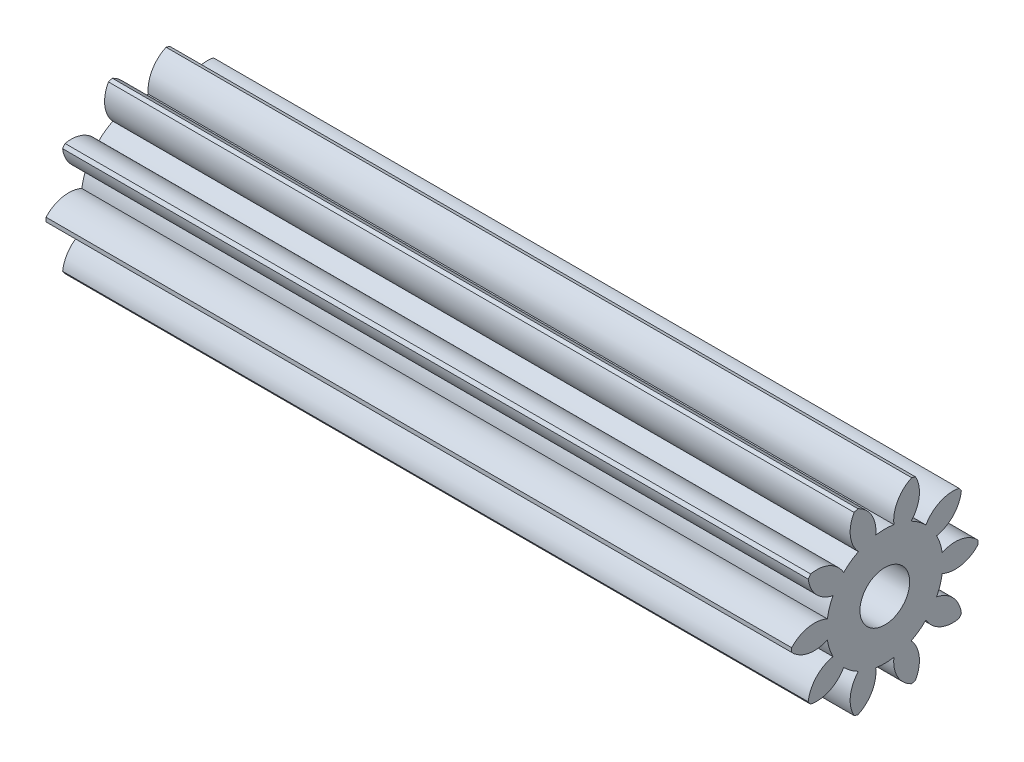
ISO-10303-21;
HEADER;
FILE_DESCRIPTION(('STEP AP214'),'2;1');
FILE_NAME('part.step','',(''),(''),'','','');
FILE_SCHEMA(('AUTOMOTIVE_DESIGN { 1 0 10303 214 1 1 1 1 }'));
ENDSEC;
DATA;
#1=APPLICATION_CONTEXT('core data for automotive mechanical design processes');
#2=APPLICATION_PROTOCOL_DEFINITION('international standard','automotive_design',2000,#1);
#3=PRODUCT_CONTEXT('',#1,'mechanical');
#4=PRODUCT('Part','Part','',(#3));
#5=PRODUCT_RELATED_PRODUCT_CATEGORY('part','',(#4));
#6=PRODUCT_DEFINITION_FORMATION('','',#4);
#7=PRODUCT_DEFINITION_CONTEXT('part definition',#1,'design');
#8=PRODUCT_DEFINITION('design','',#6,#7);
#9=PRODUCT_DEFINITION_SHAPE('','',#8);
#10=(LENGTH_UNIT() NAMED_UNIT(*) SI_UNIT(.MILLI.,.METRE.));
#11=(NAMED_UNIT(*) PLANE_ANGLE_UNIT() SI_UNIT($,.RADIAN.));
#12=(NAMED_UNIT(*) SI_UNIT($,.STERADIAN.) SOLID_ANGLE_UNIT());
#13=UNCERTAINTY_MEASURE_WITH_UNIT(LENGTH_MEASURE(1.E-05),#10,'distance_accuracy_value','');
#14=(GEOMETRIC_REPRESENTATION_CONTEXT(3) GLOBAL_UNCERTAINTY_ASSIGNED_CONTEXT((#13)) GLOBAL_UNIT_ASSIGNED_CONTEXT((#10,
#11,#12)) REPRESENTATION_CONTEXT('',''));
#15=CARTESIAN_POINT('',(0.,0.,0.));
#16=DIRECTION('',(0.,0.,1.));
#17=DIRECTION('',(1.,0.,0.));
#18=AXIS2_PLACEMENT_3D('',#15,#16,#17);
#19=CARTESIAN_POINT('',(12.,0.,0.));
#20=DIRECTION('',(-1.,0.,0.));
#21=DIRECTION('',(0.,0.,1.));
#22=AXIS2_PLACEMENT_3D('',#19,#20,#21);
#23=PLANE('',#22);
#24=CARTESIAN_POINT('',(12.,0.417375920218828,-1.09796154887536));
#25=DIRECTION('',(-1.,0.,0.));
#26=DIRECTION('',(0.,-0.587785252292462,-0.809016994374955));
#27=AXIS2_PLACEMENT_3D('',#24,#25,#26);
#28=CIRCLE('',#27,0.5);
#29=CARTESIAN_POINT('',(12.,0.662334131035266,-0.662076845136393));
#30=VERTEX_POINT('',#29);
#31=CARTESIAN_POINT('',(12.,0.908086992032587,-1.1938919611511));
#32=VERTEX_POINT('',#31);
#33=EDGE_CURVE('E304',#30,#32,#28,.T.);
#34=ORIENTED_EDGE('',*,*,#33,.F.);
#35=CARTESIAN_POINT('',(12.,0.,0.));
#36=DIRECTION('',(-1.,0.,0.));
#37=DIRECTION('',(0.,-0.587785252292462,-0.809016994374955));
#38=AXIS2_PLACEMENT_3D('',#35,#36,#37);
#39=CIRCLE('',#38,0.9365);
#40=CARTESIAN_POINT('',(12.,0.834345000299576,-0.42532419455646));
#41=VERTEX_POINT('',#40);
#42=EDGE_CURVE('E527',#41,#30,#39,.T.);
#43=ORIENTED_EDGE('',*,*,#42,.F.);
#44=CARTESIAN_POINT('',(12.,1.17319973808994,-0.0576593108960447));
#45=DIRECTION('',(-1.,0.,0.));
#46=DIRECTION('',(0.,-0.587785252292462,-0.809016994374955));
#47=AXIS2_PLACEMENT_3D('',#44,#45,#46);
#48=CIRCLE('',#47,0.5);
#49=CARTESIAN_POINT('',(12.,1.41607304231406,-0.494709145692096));
#50=VERTEX_POINT('',#49);
#51=EDGE_CURVE('E294',#50,#41,#48,.T.);
#52=ORIENTED_EDGE('',*,*,#51,.F.);
#53=CARTESIAN_POINT('',(12.,0.,0.));
#54=DIRECTION('',(-1.,0.,0.));
#55=DIRECTION('',(0.,0.,1.));
#56=AXIS2_PLACEMENT_3D('',#53,#54,#55);
#57=CIRCLE('',#56,1.5);
#58=CARTESIAN_POINT('',(12.,1.43640989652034,-0.432118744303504));
#59=VERTEX_POINT('',#58);
#60=EDGE_CURVE('E322',#59,#50,#57,.T.);
#61=ORIENTED_EDGE('',*,*,#60,.F.);
#62=CARTESIAN_POINT('',(12.,0.983029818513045,-0.642942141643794));
#63=DIRECTION('',(-1.,0.,0.));
#64=DIRECTION('',(0.,0.,-1.));
#65=AXIS2_PLACEMENT_3D('',#62,#63,#64);
#66=CIRCLE('',#65,0.5);
#67=CARTESIAN_POINT('',(12.,0.924998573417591,-0.146321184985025));
#68=VERTEX_POINT('',#67);
#69=EDGE_CURVE('E346',#68,#59,#66,.T.);
#70=ORIENTED_EDGE('',*,*,#69,.F.);
#71=CARTESIAN_POINT('',(12.,0.,0.));
#72=DIRECTION('',(-1.,0.,0.));
#73=DIRECTION('',(0.,0.,-1.));
#74=AXIS2_PLACEMENT_3D('',#71,#72,#73);
#75=CIRCLE('',#74,0.9365);
#76=CARTESIAN_POINT('',(12.,0.924998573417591,0.146321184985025));
#77=VERTEX_POINT('',#76);
#78=EDGE_CURVE('E342',#77,#68,#75,.T.);
#79=ORIENTED_EDGE('',*,*,#78,.F.);
#80=CARTESIAN_POINT('',(12.,0.983029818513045,0.642942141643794));
#81=DIRECTION('',(-1.,0.,0.));
#82=DIRECTION('',(0.,0.,-1.));
#83=AXIS2_PLACEMENT_3D('',#80,#81,#82);
#84=CIRCLE('',#83,0.5);
#85=CARTESIAN_POINT('',(12.,1.43640989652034,0.432118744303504));
#86=VERTEX_POINT('',#85);
#87=EDGE_CURVE('E344',#86,#77,#84,.T.);
#88=ORIENTED_EDGE('',*,*,#87,.F.);
#89=CARTESIAN_POINT('',(12.,1.41607304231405,0.494709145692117));
#90=VERTEX_POINT('',#89);
#91=EDGE_CURVE('E316',#90,#86,#57,.T.);
#92=ORIENTED_EDGE('',*,*,#91,.F.);
#93=CARTESIAN_POINT('',(12.,1.17319973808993,0.0576593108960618));
#94=DIRECTION('',(-1.,0.,0.));
#95=DIRECTION('',(0.,0.587785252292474,-0.809016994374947));
#96=AXIS2_PLACEMENT_3D('',#93,#94,#95);
#97=CIRCLE('',#96,0.5);
#98=CARTESIAN_POINT('',(12.,0.83434500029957,0.425324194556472));
#99=VERTEX_POINT('',#98);
#100=EDGE_CURVE('E365',#99,#90,#97,.T.);
#101=ORIENTED_EDGE('',*,*,#100,.F.);
#102=CARTESIAN_POINT('',(12.,0.,0.));
#103=DIRECTION('',(-1.,0.,0.));
#104=DIRECTION('',(0.,0.587785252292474,-0.809016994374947));
#105=AXIS2_PLACEMENT_3D('',#102,#103,#104);
#106=CIRCLE('',#105,0.9365);
#107=CARTESIAN_POINT('',(12.,0.662334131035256,0.662076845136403));
#108=VERTEX_POINT('',#107);
#109=EDGE_CURVE('E361',#108,#99,#106,.T.);
#110=ORIENTED_EDGE('',*,*,#109,.F.);
#111=CARTESIAN_POINT('',(12.,0.417375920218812,1.09796154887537));
#112=DIRECTION('',(-1.,0.,0.));
#113=DIRECTION('',(0.,0.587785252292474,-0.809016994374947));
#114=AXIS2_PLACEMENT_3D('',#111,#112,#113);
#115=CIRCLE('',#114,0.5);
#116=CARTESIAN_POINT('',(12.,0.90808699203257,1.19389196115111));
#117=VERTEX_POINT('',#116);
#118=EDGE_CURVE('E363',#117,#108,#115,.T.);
#119=ORIENTED_EDGE('',*,*,#118,.F.);
#120=CARTESIAN_POINT('',(12.,0.854844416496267,1.23257495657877));
#121=VERTEX_POINT('',#120);
#122=EDGE_CURVE('E320',#121,#117,#57,.T.);
#123=ORIENTED_EDGE('',*,*,#122,.F.);
#124=CARTESIAN_POINT('',(12.,0.915247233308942,0.73623686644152));
#125=DIRECTION('',(-1.,0.,0.));
#126=DIRECTION('',(0.,0.951056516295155,-0.309016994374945));
#127=AXIS2_PLACEMENT_3D('',#124,#125,#126);
#128=CIRCLE('',#127,0.5);
#129=CARTESIAN_POINT('',(12.,0.424999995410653,0.834510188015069));
#130=VERTEX_POINT('',#129);
#131=EDGE_CURVE('E386',#130,#121,#128,.T.);
#132=ORIENTED_EDGE('',*,*,#131,.F.);
#133=CARTESIAN_POINT('',(12.,0.,0.));
#134=DIRECTION('',(-1.,0.,0.));
#135=DIRECTION('',(0.,0.951056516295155,-0.309016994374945));
#136=AXIS2_PLACEMENT_3D('',#133,#134,#135);
#137=CIRCLE('',#136,0.9365);
#138=CARTESIAN_POINT('',(12.,0.146680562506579,0.924941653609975));
#139=VERTEX_POINT('',#138);
#140=EDGE_CURVE('E382',#139,#130,#137,.T.);
#141=ORIENTED_EDGE('',*,*,#140,.F.);
#142=CARTESIAN_POINT('',(12.,-0.307701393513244,1.13359696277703));
#143=DIRECTION('',(-1.,0.,0.));
#144=DIRECTION('',(0.,0.951056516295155,-0.309016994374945));
#145=AXIS2_PLACEMENT_3D('',#142,#143,#144);
#146=CIRCLE('',#145,0.5);
#147=CARTESIAN_POINT('',(12.,0.0329057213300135,1.49963902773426));
#148=VERTEX_POINT('',#147);
#149=EDGE_CURVE('E384',#148,#139,#146,.T.);
#150=ORIENTED_EDGE('',*,*,#149,.F.);
#151=CARTESIAN_POINT('',(12.,-0.032905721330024,1.49963902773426));
#152=VERTEX_POINT('',#151);
#153=EDGE_CURVE('E639',#152,#148,#57,.T.);
#154=ORIENTED_EDGE('',*,*,#153,.F.);
#155=CARTESIAN_POINT('',(12.,0.307701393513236,1.13359696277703));
#156=DIRECTION('',(-1.,0.,0.));
#157=DIRECTION('',(0.,0.951056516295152,0.309016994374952));
#158=AXIS2_PLACEMENT_3D('',#155,#156,#157);
#159=CIRCLE('',#158,0.5);
#160=CARTESIAN_POINT('',(12.,-0.146680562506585,0.924941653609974));
#161=VERTEX_POINT('',#160);
#162=EDGE_CURVE('E408',#161,#152,#159,.T.);
#163=ORIENTED_EDGE('',*,*,#162,.F.);
#164=CARTESIAN_POINT('',(12.,0.,0.));
#165=DIRECTION('',(-1.,0.,0.));
#166=DIRECTION('',(0.,0.951056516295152,0.309016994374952));
#167=AXIS2_PLACEMENT_3D('',#164,#165,#166);
#168=CIRCLE('',#167,0.9365);
#169=CARTESIAN_POINT('',(12.,-0.424999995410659,0.834510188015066));
#170=VERTEX_POINT('',#169);
#171=EDGE_CURVE('E404',#170,#161,#168,.T.);
#172=ORIENTED_EDGE('',*,*,#171,.F.);
#173=CARTESIAN_POINT('',(12.,-0.915247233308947,0.736236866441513));
#174=DIRECTION('',(-1.,0.,0.));
#175=DIRECTION('',(0.,0.951056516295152,0.309016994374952));
#176=AXIS2_PLACEMENT_3D('',#173,#174,#175);
#177=CIRCLE('',#176,0.5);
#178=CARTESIAN_POINT('',(12.,-0.854844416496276,1.23257495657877));
#179=VERTEX_POINT('',#178);
#180=EDGE_CURVE('E406',#179,#170,#177,.T.);
#181=ORIENTED_EDGE('',*,*,#180,.F.);
#182=CARTESIAN_POINT('',(12.,-0.908086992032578,1.1938919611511));
#183=VERTEX_POINT('',#182);
#184=EDGE_CURVE('E634',#183,#179,#57,.T.);
#185=ORIENTED_EDGE('',*,*,#184,.F.);
#186=CARTESIAN_POINT('',(12.,-0.41737592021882,1.09796154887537));
#187=DIRECTION('',(-1.,0.,0.));
#188=DIRECTION('',(0.,0.587785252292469,0.809016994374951));
#189=AXIS2_PLACEMENT_3D('',#186,#187,#188);
#190=CIRCLE('',#189,0.5);
#191=CARTESIAN_POINT('',(12.,-0.662334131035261,0.662076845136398));
#192=VERTEX_POINT('',#191);
#193=EDGE_CURVE('E430',#192,#183,#190,.T.);
#194=ORIENTED_EDGE('',*,*,#193,.F.);
#195=CARTESIAN_POINT('',(12.,0.,0.));
#196=DIRECTION('',(-1.,0.,0.));
#197=DIRECTION('',(0.,0.587785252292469,0.809016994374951));
#198=AXIS2_PLACEMENT_3D('',#195,#196,#197);
#199=CIRCLE('',#198,0.9365);
#200=CARTESIAN_POINT('',(12.,-0.834345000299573,0.425324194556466));
#201=VERTEX_POINT('',#200);
#202=EDGE_CURVE('E426',#201,#192,#199,.T.);
#203=ORIENTED_EDGE('',*,*,#202,.F.);
#204=CARTESIAN_POINT('',(12.,-1.17319973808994,0.0576593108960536));
#205=DIRECTION('',(-1.,0.,0.));
#206=DIRECTION('',(0.,0.587785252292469,0.809016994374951));
#207=AXIS2_PLACEMENT_3D('',#204,#205,#206);
#208=CIRCLE('',#207,0.5);
#209=CARTESIAN_POINT('',(12.,-1.41607304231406,0.494709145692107));
#210=VERTEX_POINT('',#209);
#211=EDGE_CURVE('E428',#210,#201,#208,.T.);
#212=ORIENTED_EDGE('',*,*,#211,.F.);
#213=CARTESIAN_POINT('',(12.,-1.43640989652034,0.432118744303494));
#214=VERTEX_POINT('',#213);
#215=EDGE_CURVE('E629',#214,#210,#57,.T.);
#216=ORIENTED_EDGE('',*,*,#215,.F.);
#217=CARTESIAN_POINT('',(12.,-0.98302981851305,0.642942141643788));
#218=DIRECTION('',(-1.,0.,0.));
#219=DIRECTION('',(0.,0.,1.));
#220=AXIS2_PLACEMENT_3D('',#217,#218,#219);
#221=CIRCLE('',#220,0.5);
#222=CARTESIAN_POINT('',(12.,-0.924998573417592,0.146321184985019));
#223=VERTEX_POINT('',#222);
#224=EDGE_CURVE('E452',#223,#214,#221,.T.);
#225=ORIENTED_EDGE('',*,*,#224,.F.);
#226=CARTESIAN_POINT('',(12.,0.,0.));
#227=DIRECTION('',(-1.,0.,0.));
#228=DIRECTION('',(0.,0.,1.));
#229=AXIS2_PLACEMENT_3D('',#226,#227,#228);
#230=CIRCLE('',#229,0.9365);
#231=CARTESIAN_POINT('',(12.,-0.92499857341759,-0.146321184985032));
#232=VERTEX_POINT('',#231);
#233=EDGE_CURVE('E448',#232,#223,#230,.T.);
#234=ORIENTED_EDGE('',*,*,#233,.F.);
#235=CARTESIAN_POINT('',(12.,-0.983029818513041,-0.642942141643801));
#236=DIRECTION('',(-1.,0.,0.));
#237=DIRECTION('',(0.,0.,1.));
#238=AXIS2_PLACEMENT_3D('',#235,#236,#237);
#239=CIRCLE('',#238,0.5);
#240=CARTESIAN_POINT('',(12.,-1.43640989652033,-0.432118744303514));
#241=VERTEX_POINT('',#240);
#242=EDGE_CURVE('E450',#241,#232,#239,.T.);
#243=ORIENTED_EDGE('',*,*,#242,.F.);
#244=CARTESIAN_POINT('',(12.,-1.41607304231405,-0.494709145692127));
#245=VERTEX_POINT('',#244);
#246=EDGE_CURVE('E624',#245,#241,#57,.T.);
#247=ORIENTED_EDGE('',*,*,#246,.F.);
#248=CARTESIAN_POINT('',(12.,-1.17319973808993,-0.0576593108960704));
#249=DIRECTION('',(-1.,0.,0.));
#250=DIRECTION('',(0.,-0.58778525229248,0.809016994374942));
#251=AXIS2_PLACEMENT_3D('',#248,#249,#250);
#252=CIRCLE('',#251,0.5);
#253=CARTESIAN_POINT('',(12.,-0.834345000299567,-0.425324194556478));
#254=VERTEX_POINT('',#253);
#255=EDGE_CURVE('E474',#254,#245,#252,.T.);
#256=ORIENTED_EDGE('',*,*,#255,.F.);
#257=CARTESIAN_POINT('',(12.,0.,0.));
#258=DIRECTION('',(-1.,0.,0.));
#259=DIRECTION('',(0.,-0.58778525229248,0.809016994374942));
#260=AXIS2_PLACEMENT_3D('',#257,#258,#259);
#261=CIRCLE('',#260,0.9365);
#262=CARTESIAN_POINT('',(12.,-0.662334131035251,-0.662076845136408));
#263=VERTEX_POINT('',#262);
#264=EDGE_CURVE('E470',#263,#254,#261,.T.);
#265=ORIENTED_EDGE('',*,*,#264,.F.);
#266=CARTESIAN_POINT('',(12.,-0.417375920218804,-1.09796154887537));
#267=DIRECTION('',(-1.,0.,0.));
#268=DIRECTION('',(0.,-0.58778525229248,0.809016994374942));
#269=AXIS2_PLACEMENT_3D('',#266,#267,#268);
#270=CIRCLE('',#269,0.5);
#271=CARTESIAN_POINT('',(12.,-0.908086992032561,-1.19389196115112));
#272=VERTEX_POINT('',#271);
#273=EDGE_CURVE('E472',#272,#263,#270,.T.);
#274=ORIENTED_EDGE('',*,*,#273,.F.);
#275=CARTESIAN_POINT('',(12.,-0.854844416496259,-1.23257495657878));
#276=VERTEX_POINT('',#275);
#277=EDGE_CURVE('E619',#276,#272,#57,.T.);
#278=ORIENTED_EDGE('',*,*,#277,.F.);
#279=CARTESIAN_POINT('',(12.,-0.915247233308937,-0.736236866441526));
#280=DIRECTION('',(-1.,0.,0.));
#281=DIRECTION('',(0.,-0.951056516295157,0.309016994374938));
#282=AXIS2_PLACEMENT_3D('',#279,#280,#281);
#283=CIRCLE('',#282,0.5);
#284=CARTESIAN_POINT('',(12.,-0.424999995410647,-0.834510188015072));
#285=VERTEX_POINT('',#284);
#286=EDGE_CURVE('E496',#285,#276,#283,.T.);
#287=ORIENTED_EDGE('',*,*,#286,.F.);
#288=CARTESIAN_POINT('',(12.,0.,0.));
#289=DIRECTION('',(-1.,0.,0.));
#290=DIRECTION('',(0.,-0.951056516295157,0.309016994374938));
#291=AXIS2_PLACEMENT_3D('',#288,#289,#290);
#292=CIRCLE('',#291,0.9365);
#293=CARTESIAN_POINT('',(12.,-0.146680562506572,-0.924941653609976));
#294=VERTEX_POINT('',#293);
#295=EDGE_CURVE('E492',#294,#285,#292,.T.);
#296=ORIENTED_EDGE('',*,*,#295,.F.);
#297=CARTESIAN_POINT('',(12.,0.307701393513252,-1.13359696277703));
#298=DIRECTION('',(-1.,0.,0.));
#299=DIRECTION('',(0.,-0.951056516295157,0.309016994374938));
#300=AXIS2_PLACEMENT_3D('',#297,#298,#299);
#301=CIRCLE('',#300,0.5);
#302=CARTESIAN_POINT('',(12.,-0.0329057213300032,-1.49963902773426));
#303=VERTEX_POINT('',#302);
#304=EDGE_CURVE('E494',#303,#294,#301,.T.);
#305=ORIENTED_EDGE('',*,*,#304,.F.);
#306=CARTESIAN_POINT('',(12.,0.0329057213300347,-1.49963902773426));
#307=VERTEX_POINT('',#306);
#308=EDGE_CURVE('E618',#307,#303,#57,.T.);
#309=ORIENTED_EDGE('',*,*,#308,.F.);
#310=CARTESIAN_POINT('',(12.,-0.307701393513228,-1.13359696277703));
#311=DIRECTION('',(-1.,0.,0.));
#312=DIRECTION('',(0.,-0.95105651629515,-0.309016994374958));
#313=AXIS2_PLACEMENT_3D('',#310,#311,#312);
#314=CIRCLE('',#313,0.5);
#315=CARTESIAN_POINT('',(12.,0.146680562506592,-0.924941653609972));
#316=VERTEX_POINT('',#315);
#317=EDGE_CURVE('E517',#316,#307,#314,.T.);
#318=ORIENTED_EDGE('',*,*,#317,.F.);
#319=CARTESIAN_POINT('',(12.,0.,0.));
#320=DIRECTION('',(-1.,0.,0.));
#321=DIRECTION('',(0.,-0.95105651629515,-0.309016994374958));
#322=AXIS2_PLACEMENT_3D('',#319,#320,#321);
#323=CIRCLE('',#322,0.9365);
#324=CARTESIAN_POINT('',(12.,0.424999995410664,-0.834510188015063));
#325=VERTEX_POINT('',#324);
#326=EDGE_CURVE('E513',#325,#316,#323,.T.);
#327=ORIENTED_EDGE('',*,*,#326,.F.);
#328=CARTESIAN_POINT('',(12.,0.915247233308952,-0.736236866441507));
#329=DIRECTION('',(-1.,0.,0.));
#330=DIRECTION('',(0.,-0.95105651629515,-0.309016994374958));
#331=AXIS2_PLACEMENT_3D('',#328,#329,#330);
#332=CIRCLE('',#331,0.5);
#333=CARTESIAN_POINT('',(12.,0.854844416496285,-1.23257495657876));
#334=VERTEX_POINT('',#333);
#335=EDGE_CURVE('E515',#334,#325,#332,.T.);
#336=ORIENTED_EDGE('',*,*,#335,.F.);
#337=EDGE_CURVE('E588',#32,#334,#57,.T.);
#338=ORIENTED_EDGE('',*,*,#337,.F.);
#339=EDGE_LOOP('',(#34,#43,#52,#61,#70,#79,#88,#92,#101,#110,#119,#123,#132,#141,#150,#154,#163,
#172,#181,#185,#194,#203,#212,#216,#225,#234,#243,#247,#256,#265,#274,#278,#287,#296,#305,#309,
#318,#327,#336,#338));
#340=FACE_BOUND('',#339,.T.);
#341=CARTESIAN_POINT('',(12.,0.,0.));
#342=DIRECTION('',(-1.,0.,0.));
#343=DIRECTION('',(0.,0.,1.));
#344=AXIS2_PLACEMENT_3D('',#341,#342,#343);
#345=CIRCLE('',#344,0.399999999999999);
#346=CARTESIAN_POINT('',(12.,0.,0.399999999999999));
#347=VERTEX_POINT('',#346);
#348=EDGE_CURVE('E532',#347,#347,#345,.F.);
#349=ORIENTED_EDGE('',*,*,#348,.F.);
#350=EDGE_LOOP('',(#349));
#351=FACE_BOUND('',#350,.T.);
#352=ADVANCED_FACE('F31',(#340,#351),#23,.F.);
#353=CARTESIAN_POINT('',(0.,0.,0.));
#354=DIRECTION('',(1.,0.,0.));
#355=DIRECTION('',(0.,0.,-1.));
#356=AXIS2_PLACEMENT_3D('',#353,#354,#355);
#357=PLANE('',#356);
#358=CARTESIAN_POINT('',(0.,0.417375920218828,-1.09796154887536));
#359=DIRECTION('',(-1.,0.,0.));
#360=DIRECTION('',(0.,-0.587785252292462,-0.809016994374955));
#361=AXIS2_PLACEMENT_3D('',#358,#359,#360);
#362=CIRCLE('',#361,0.5);
#363=CARTESIAN_POINT('',(0.,0.662334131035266,-0.662076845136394));
#364=VERTEX_POINT('',#363);
#365=CARTESIAN_POINT('',(0.,0.908086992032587,-1.1938919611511));
#366=VERTEX_POINT('',#365);
#367=EDGE_CURVE('E46',#364,#366,#362,.T.);
#368=ORIENTED_EDGE('',*,*,#367,.T.);
#369=CARTESIAN_POINT('',(0.,0.,0.));
#370=DIRECTION('',(-1.,0.,0.));
#371=DIRECTION('',(0.,0.,1.));
#372=AXIS2_PLACEMENT_3D('',#369,#370,#371);
#373=CIRCLE('',#372,1.5);
#374=CARTESIAN_POINT('',(0.,0.854844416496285,-1.23257495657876));
#375=VERTEX_POINT('',#374);
#376=EDGE_CURVE('E317',#366,#375,#373,.T.);
#377=ORIENTED_EDGE('',*,*,#376,.T.);
#378=CARTESIAN_POINT('',(0.,0.915247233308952,-0.736236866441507));
#379=DIRECTION('',(1.,0.,0.));
#380=DIRECTION('',(0.,0.,-1.));
#381=AXIS2_PLACEMENT_3D('',#378,#379,#380);
#382=CIRCLE('',#381,0.5);
#383=CARTESIAN_POINT('',(0.,0.424999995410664,-0.834510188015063));
#384=VERTEX_POINT('',#383);
#385=EDGE_CURVE('E39',#384,#375,#382,.T.);
#386=ORIENTED_EDGE('',*,*,#385,.F.);
#387=CARTESIAN_POINT('',(0.,0.,0.));
#388=DIRECTION('',(-1.,0.,0.));
#389=DIRECTION('',(0.,-0.95105651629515,-0.309016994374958));
#390=AXIS2_PLACEMENT_3D('',#387,#388,#389);
#391=CIRCLE('',#390,0.9365);
#392=CARTESIAN_POINT('',(0.,0.146680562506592,-0.924941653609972));
#393=VERTEX_POINT('',#392);
#394=EDGE_CURVE('E519',#384,#393,#391,.T.);
#395=ORIENTED_EDGE('',*,*,#394,.T.);
#396=CARTESIAN_POINT('',(0.,-0.307701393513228,-1.13359696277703));
#397=DIRECTION('',(-1.,0.,0.));
#398=DIRECTION('',(0.,-0.95105651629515,-0.309016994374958));
#399=AXIS2_PLACEMENT_3D('',#396,#397,#398);
#400=CIRCLE('',#399,0.5);
#401=CARTESIAN_POINT('',(0.,0.0329057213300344,-1.49963902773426));
#402=VERTEX_POINT('',#401);
#403=EDGE_CURVE('E54',#393,#402,#400,.T.);
#404=ORIENTED_EDGE('',*,*,#403,.T.);
#405=CARTESIAN_POINT('',(0.,-0.0329057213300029,-1.49963902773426));
#406=VERTEX_POINT('',#405);
#407=EDGE_CURVE('E323',#402,#406,#373,.T.);
#408=ORIENTED_EDGE('',*,*,#407,.T.);
#409=CARTESIAN_POINT('',(0.,0.307701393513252,-1.13359696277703));
#410=DIRECTION('',(1.,0.,0.));
#411=DIRECTION('',(0.,0.,-1.));
#412=AXIS2_PLACEMENT_3D('',#409,#410,#411);
#413=CIRCLE('',#412,0.5);
#414=CARTESIAN_POINT('',(0.,-0.146680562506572,-0.924941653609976));
#415=VERTEX_POINT('',#414);
#416=EDGE_CURVE('E604',#415,#406,#413,.T.);
#417=ORIENTED_EDGE('',*,*,#416,.F.);
#418=CARTESIAN_POINT('',(0.,0.,0.));
#419=DIRECTION('',(-1.,0.,0.));
#420=DIRECTION('',(0.,-0.951056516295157,0.309016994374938));
#421=AXIS2_PLACEMENT_3D('',#418,#419,#420);
#422=CIRCLE('',#421,0.9365);
#423=CARTESIAN_POINT('',(0.,-0.424999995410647,-0.834510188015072));
#424=VERTEX_POINT('',#423);
#425=EDGE_CURVE('E498',#415,#424,#422,.T.);
#426=ORIENTED_EDGE('',*,*,#425,.T.);
#427=CARTESIAN_POINT('',(0.,-0.915247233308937,-0.736236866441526));
#428=DIRECTION('',(-1.,0.,0.));
#429=DIRECTION('',(0.,-0.951056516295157,0.309016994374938));
#430=AXIS2_PLACEMENT_3D('',#427,#428,#429);
#431=CIRCLE('',#430,0.5);
#432=CARTESIAN_POINT('',(0.,-0.854844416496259,-1.23257495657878));
#433=VERTEX_POINT('',#432);
#434=EDGE_CURVE('E501',#424,#433,#431,.T.);
#435=ORIENTED_EDGE('',*,*,#434,.T.);
#436=CARTESIAN_POINT('',(0.,-0.908086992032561,-1.19389196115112));
#437=VERTEX_POINT('',#436);
#438=EDGE_CURVE('E684',#433,#437,#373,.T.);
#439=ORIENTED_EDGE('',*,*,#438,.T.);
#440=CARTESIAN_POINT('',(0.,-0.417375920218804,-1.09796154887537));
#441=DIRECTION('',(1.,0.,0.));
#442=DIRECTION('',(0.,0.,-1.));
#443=AXIS2_PLACEMENT_3D('',#440,#441,#442);
#444=CIRCLE('',#443,0.5);
#445=CARTESIAN_POINT('',(0.,-0.662334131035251,-0.662076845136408));
#446=VERTEX_POINT('',#445);
#447=EDGE_CURVE('E601',#446,#437,#444,.T.);
#448=ORIENTED_EDGE('',*,*,#447,.F.);
#449=CARTESIAN_POINT('',(0.,0.,0.));
#450=DIRECTION('',(-1.,0.,0.));
#451=DIRECTION('',(0.,-0.58778525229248,0.809016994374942));
#452=AXIS2_PLACEMENT_3D('',#449,#450,#451);
#453=CIRCLE('',#452,0.9365);
#454=CARTESIAN_POINT('',(0.,-0.834345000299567,-0.425324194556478));
#455=VERTEX_POINT('',#454);
#456=EDGE_CURVE('E476',#446,#455,#453,.T.);
#457=ORIENTED_EDGE('',*,*,#456,.T.);
#458=CARTESIAN_POINT('',(0.,-1.17319973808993,-0.0576593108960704));
#459=DIRECTION('',(-1.,0.,0.));
#460=DIRECTION('',(0.,-0.58778525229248,0.809016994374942));
#461=AXIS2_PLACEMENT_3D('',#458,#459,#460);
#462=CIRCLE('',#461,0.5);
#463=CARTESIAN_POINT('',(0.,-1.41607304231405,-0.494709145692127));
#464=VERTEX_POINT('',#463);
#465=EDGE_CURVE('E479',#455,#464,#462,.T.);
#466=ORIENTED_EDGE('',*,*,#465,.T.);
#467=CARTESIAN_POINT('',(0.,-1.43640989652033,-0.432118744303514));
#468=VERTEX_POINT('',#467);
#469=EDGE_CURVE('E681',#464,#468,#373,.T.);
#470=ORIENTED_EDGE('',*,*,#469,.T.);
#471=CARTESIAN_POINT('',(0.,-0.983029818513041,-0.642942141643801));
#472=DIRECTION('',(1.,0.,0.));
#473=DIRECTION('',(0.,0.,-1.));
#474=AXIS2_PLACEMENT_3D('',#471,#472,#473);
#475=CIRCLE('',#474,0.5);
#476=CARTESIAN_POINT('',(0.,-0.92499857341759,-0.146321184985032));
#477=VERTEX_POINT('',#476);
#478=EDGE_CURVE('E598',#477,#468,#475,.T.);
#479=ORIENTED_EDGE('',*,*,#478,.F.);
#480=CARTESIAN_POINT('',(0.,0.,0.));
#481=DIRECTION('',(-1.,0.,0.));
#482=DIRECTION('',(0.,0.,1.));
#483=AXIS2_PLACEMENT_3D('',#480,#481,#482);
#484=CIRCLE('',#483,0.9365);
#485=CARTESIAN_POINT('',(0.,-0.924998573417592,0.146321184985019));
#486=VERTEX_POINT('',#485);
#487=EDGE_CURVE('E454',#477,#486,#484,.T.);
#488=ORIENTED_EDGE('',*,*,#487,.T.);
#489=CARTESIAN_POINT('',(0.,-0.98302981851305,0.642942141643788));
#490=DIRECTION('',(-1.,0.,0.));
#491=DIRECTION('',(0.,0.,1.));
#492=AXIS2_PLACEMENT_3D('',#489,#490,#491);
#493=CIRCLE('',#492,0.5);
#494=CARTESIAN_POINT('',(0.,-1.43640989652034,0.432118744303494));
#495=VERTEX_POINT('',#494);
#496=EDGE_CURVE('E457',#486,#495,#493,.T.);
#497=ORIENTED_EDGE('',*,*,#496,.T.);
#498=CARTESIAN_POINT('',(0.,-1.41607304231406,0.494709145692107));
#499=VERTEX_POINT('',#498);
#500=EDGE_CURVE('E678',#495,#499,#373,.T.);
#501=ORIENTED_EDGE('',*,*,#500,.T.);
#502=CARTESIAN_POINT('',(0.,-1.17319973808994,0.0576593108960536));
#503=DIRECTION('',(1.,0.,0.));
#504=DIRECTION('',(0.,0.,-1.));
#505=AXIS2_PLACEMENT_3D('',#502,#503,#504);
#506=CIRCLE('',#505,0.5);
#507=CARTESIAN_POINT('',(0.,-0.834345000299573,0.425324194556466));
#508=VERTEX_POINT('',#507);
#509=EDGE_CURVE('E595',#508,#499,#506,.T.);
#510=ORIENTED_EDGE('',*,*,#509,.F.);
#511=CARTESIAN_POINT('',(0.,0.,0.));
#512=DIRECTION('',(-1.,0.,0.));
#513=DIRECTION('',(0.,0.587785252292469,0.809016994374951));
#514=AXIS2_PLACEMENT_3D('',#511,#512,#513);
#515=CIRCLE('',#514,0.9365);
#516=CARTESIAN_POINT('',(0.,-0.662334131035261,0.662076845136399));
#517=VERTEX_POINT('',#516);
#518=EDGE_CURVE('E432',#508,#517,#515,.T.);
#519=ORIENTED_EDGE('',*,*,#518,.T.);
#520=CARTESIAN_POINT('',(0.,-0.41737592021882,1.09796154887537));
#521=DIRECTION('',(-1.,0.,0.));
#522=DIRECTION('',(0.,0.587785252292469,0.809016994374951));
#523=AXIS2_PLACEMENT_3D('',#520,#521,#522);
#524=CIRCLE('',#523,0.5);
#525=CARTESIAN_POINT('',(0.,-0.908086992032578,1.1938919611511));
#526=VERTEX_POINT('',#525);
#527=EDGE_CURVE('E435',#517,#526,#524,.T.);
#528=ORIENTED_EDGE('',*,*,#527,.T.);
#529=CARTESIAN_POINT('',(0.,-0.854844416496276,1.23257495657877));
#530=VERTEX_POINT('',#529);
#531=EDGE_CURVE('E677',#526,#530,#373,.T.);
#532=ORIENTED_EDGE('',*,*,#531,.T.);
#533=CARTESIAN_POINT('',(0.,-0.915247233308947,0.736236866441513));
#534=DIRECTION('',(1.,0.,0.));
#535=DIRECTION('',(0.,0.,-1.));
#536=AXIS2_PLACEMENT_3D('',#533,#534,#535);
#537=CIRCLE('',#536,0.5);
#538=CARTESIAN_POINT('',(0.,-0.424999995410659,0.834510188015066));
#539=VERTEX_POINT('',#538);
#540=EDGE_CURVE('E592',#539,#530,#537,.T.);
#541=ORIENTED_EDGE('',*,*,#540,.F.);
#542=CARTESIAN_POINT('',(0.,0.,0.));
#543=DIRECTION('',(-1.,0.,0.));
#544=DIRECTION('',(0.,0.951056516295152,0.309016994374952));
#545=AXIS2_PLACEMENT_3D('',#542,#543,#544);
#546=CIRCLE('',#545,0.9365);
#547=CARTESIAN_POINT('',(0.,-0.146680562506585,0.924941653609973));
#548=VERTEX_POINT('',#547);
#549=EDGE_CURVE('E410',#539,#548,#546,.T.);
#550=ORIENTED_EDGE('',*,*,#549,.T.);
#551=CARTESIAN_POINT('',(0.,0.307701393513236,1.13359696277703));
#552=DIRECTION('',(-1.,0.,0.));
#553=DIRECTION('',(0.,0.951056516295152,0.309016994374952));
#554=AXIS2_PLACEMENT_3D('',#551,#552,#553);
#555=CIRCLE('',#554,0.5);
#556=CARTESIAN_POINT('',(0.,-0.0329057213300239,1.49963902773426));
#557=VERTEX_POINT('',#556);
#558=EDGE_CURVE('E413',#548,#557,#555,.T.);
#559=ORIENTED_EDGE('',*,*,#558,.T.);
#560=CARTESIAN_POINT('',(0.,0.0329057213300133,1.49963902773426));
#561=VERTEX_POINT('',#560);
#562=EDGE_CURVE('E331',#557,#561,#373,.T.);
#563=ORIENTED_EDGE('',*,*,#562,.T.);
#564=CARTESIAN_POINT('',(0.,-0.307701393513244,1.13359696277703));
#565=DIRECTION('',(1.,0.,0.));
#566=DIRECTION('',(0.,0.,-1.));
#567=AXIS2_PLACEMENT_3D('',#564,#565,#566);
#568=CIRCLE('',#567,0.5);
#569=CARTESIAN_POINT('',(0.,0.146680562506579,0.924941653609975));
#570=VERTEX_POINT('',#569);
#571=EDGE_CURVE('E585',#570,#561,#568,.T.);
#572=ORIENTED_EDGE('',*,*,#571,.F.);
#573=CARTESIAN_POINT('',(0.,0.,0.));
#574=DIRECTION('',(-1.,0.,0.));
#575=DIRECTION('',(0.,0.951056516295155,-0.309016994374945));
#576=AXIS2_PLACEMENT_3D('',#573,#574,#575);
#577=CIRCLE('',#576,0.9365);
#578=CARTESIAN_POINT('',(0.,0.424999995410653,0.834510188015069));
#579=VERTEX_POINT('',#578);
#580=EDGE_CURVE('E388',#570,#579,#577,.T.);
#581=ORIENTED_EDGE('',*,*,#580,.T.);
#582=CARTESIAN_POINT('',(0.,0.915247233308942,0.73623686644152));
#583=DIRECTION('',(-1.,0.,0.));
#584=DIRECTION('',(0.,0.951056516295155,-0.309016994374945));
#585=AXIS2_PLACEMENT_3D('',#582,#583,#584);
#586=CIRCLE('',#585,0.5);
#587=CARTESIAN_POINT('',(0.,0.854844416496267,1.23257495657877));
#588=VERTEX_POINT('',#587);
#589=EDGE_CURVE('E391',#579,#588,#586,.T.);
#590=ORIENTED_EDGE('',*,*,#589,.T.);
#591=CARTESIAN_POINT('',(0.,0.90808699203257,1.19389196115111));
#592=VERTEX_POINT('',#591);
#593=EDGE_CURVE('E325',#588,#592,#373,.T.);
#594=ORIENTED_EDGE('',*,*,#593,.T.);
#595=CARTESIAN_POINT('',(0.,0.417375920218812,1.09796154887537));
#596=DIRECTION('',(1.,0.,0.));
#597=DIRECTION('',(0.,0.,-1.));
#598=AXIS2_PLACEMENT_3D('',#595,#596,#597);
#599=CIRCLE('',#598,0.5);
#600=CARTESIAN_POINT('',(0.,0.662334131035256,0.662076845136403));
#601=VERTEX_POINT('',#600);
#602=EDGE_CURVE('E582',#601,#592,#599,.T.);
#603=ORIENTED_EDGE('',*,*,#602,.F.);
#604=CARTESIAN_POINT('',(0.,0.,0.));
#605=DIRECTION('',(-1.,0.,0.));
#606=DIRECTION('',(0.,0.587785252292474,-0.809016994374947));
#607=AXIS2_PLACEMENT_3D('',#604,#605,#606);
#608=CIRCLE('',#607,0.9365);
#609=CARTESIAN_POINT('',(0.,0.83434500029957,0.425324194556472));
#610=VERTEX_POINT('',#609);
#611=EDGE_CURVE('E367',#601,#610,#608,.T.);
#612=ORIENTED_EDGE('',*,*,#611,.T.);
#613=CARTESIAN_POINT('',(0.,1.17319973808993,0.0576593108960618));
#614=DIRECTION('',(-1.,0.,0.));
#615=DIRECTION('',(0.,0.587785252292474,-0.809016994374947));
#616=AXIS2_PLACEMENT_3D('',#613,#614,#615);
#617=CIRCLE('',#616,0.5);
#618=CARTESIAN_POINT('',(0.,1.41607304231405,0.494709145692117));
#619=VERTEX_POINT('',#618);
#620=EDGE_CURVE('E370',#610,#619,#617,.T.);
#621=ORIENTED_EDGE('',*,*,#620,.T.);
#622=CARTESIAN_POINT('',(0.,1.43640989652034,0.432118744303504));
#623=VERTEX_POINT('',#622);
#624=EDGE_CURVE('E319',#619,#623,#373,.T.);
#625=ORIENTED_EDGE('',*,*,#624,.T.);
#626=CARTESIAN_POINT('',(0.,0.983029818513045,0.642942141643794));
#627=DIRECTION('',(1.,0.,0.));
#628=DIRECTION('',(0.,0.,-1.));
#629=AXIS2_PLACEMENT_3D('',#626,#627,#628);
#630=CIRCLE('',#629,0.5);
#631=CARTESIAN_POINT('',(0.,0.924998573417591,0.146321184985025));
#632=VERTEX_POINT('',#631);
#633=EDGE_CURVE('E581',#632,#623,#630,.T.);
#634=ORIENTED_EDGE('',*,*,#633,.F.);
#635=CARTESIAN_POINT('',(0.,0.,0.));
#636=DIRECTION('',(-1.,0.,0.));
#637=DIRECTION('',(0.,0.,-1.));
#638=AXIS2_PLACEMENT_3D('',#635,#636,#637);
#639=CIRCLE('',#638,0.9365);
#640=CARTESIAN_POINT('',(0.,0.924998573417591,-0.146321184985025));
#641=VERTEX_POINT('',#640);
#642=EDGE_CURVE('E348',#632,#641,#639,.T.);
#643=ORIENTED_EDGE('',*,*,#642,.T.);
#644=CARTESIAN_POINT('',(0.,0.983029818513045,-0.642942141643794));
#645=DIRECTION('',(-1.,0.,0.));
#646=DIRECTION('',(0.,0.,-1.));
#647=AXIS2_PLACEMENT_3D('',#644,#645,#646);
#648=CIRCLE('',#647,0.5);
#649=CARTESIAN_POINT('',(0.,1.43640989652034,-0.432118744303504));
#650=VERTEX_POINT('',#649);
#651=EDGE_CURVE('E313',#641,#650,#648,.T.);
#652=ORIENTED_EDGE('',*,*,#651,.T.);
#653=CARTESIAN_POINT('',(0.,1.41607304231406,-0.494709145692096));
#654=VERTEX_POINT('',#653);
#655=EDGE_CURVE('E311',#650,#654,#373,.T.);
#656=ORIENTED_EDGE('',*,*,#655,.T.);
#657=CARTESIAN_POINT('',(0.,1.17319973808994,-0.0576593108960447));
#658=DIRECTION('',(1.,0.,0.));
#659=DIRECTION('',(0.,0.,-1.));
#660=AXIS2_PLACEMENT_3D('',#657,#658,#659);
#661=CIRCLE('',#660,0.5);
#662=CARTESIAN_POINT('',(0.,0.834345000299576,-0.42532419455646));
#663=VERTEX_POINT('',#662);
#664=EDGE_CURVE('E11',#663,#654,#661,.T.);
#665=ORIENTED_EDGE('',*,*,#664,.F.);
#666=CARTESIAN_POINT('',(0.,0.,0.));
#667=DIRECTION('',(-1.,0.,0.));
#668=DIRECTION('',(0.,-0.587785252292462,-0.809016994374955));
#669=AXIS2_PLACEMENT_3D('',#666,#667,#668);
#670=CIRCLE('',#669,0.9365);
#671=EDGE_CURVE('E301',#663,#364,#670,.T.);
#672=ORIENTED_EDGE('',*,*,#671,.T.);
#673=EDGE_LOOP('',(#368,#377,#386,#395,#404,#408,#417,#426,#435,#439,#448,#457,#466,#470,#479,
#488,#497,#501,#510,#519,#528,#532,#541,#550,#559,#563,#572,#581,#590,#594,#603,#612,#621,#625,
#634,#643,#652,#656,#665,#672));
#674=FACE_BOUND('',#673,.T.);
#675=CARTESIAN_POINT('',(0.,0.,0.));
#676=DIRECTION('',(1.,0.,0.));
#677=DIRECTION('',(0.,0.,-1.));
#678=AXIS2_PLACEMENT_3D('',#675,#676,#677);
#679=CIRCLE('',#678,0.399999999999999);
#680=CARTESIAN_POINT('',(0.,0.,-0.399999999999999));
#681=VERTEX_POINT('',#680);
#682=EDGE_CURVE('E34',#681,#681,#679,.F.);
#683=ORIENTED_EDGE('',*,*,#682,.F.);
#684=EDGE_LOOP('',(#683));
#685=FACE_BOUND('',#684,.T.);
#686=ADVANCED_FACE('F307',(#674,#685),#357,.F.);
#687=CARTESIAN_POINT('',(-10.,0.,0.));
#688=DIRECTION('',(-1.,0.,0.));
#689=DIRECTION('',(0.,0.,1.));
#690=AXIS2_PLACEMENT_3D('',#687,#688,#689);
#691=CYLINDRICAL_SURFACE('',#690,1.5);
#692=DIRECTION('',(-1.,0.,0.));
#693=VECTOR('',#692,1.);
#694=CARTESIAN_POINT('',(6.,0.908086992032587,-1.1938919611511));
#695=LINE('',#694,#693);
#696=EDGE_CURVE('E523',#32,#366,#695,.T.);
#697=ORIENTED_EDGE('',*,*,#696,.F.);
#698=ORIENTED_EDGE('',*,*,#337,.T.);
#699=DIRECTION('',(-1.,0.,0.));
#700=VECTOR('',#699,1.);
#701=CARTESIAN_POINT('',(6.,0.854844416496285,-1.23257495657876));
#702=LINE('',#701,#700);
#703=EDGE_CURVE('E506',#375,#334,#702,.F.);
#704=ORIENTED_EDGE('',*,*,#703,.F.);
#705=ORIENTED_EDGE('',*,*,#376,.F.);
#706=EDGE_LOOP('',(#697,#698,#704,#705));
#707=FACE_BOUND('',#706,.T.);
#708=ADVANCED_FACE('F541',(#707),#691,.T.);
#709=DIRECTION('',(-1.,0.,0.));
#710=VECTOR('',#709,1.);
#711=CARTESIAN_POINT('',(6.,1.41607304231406,-0.494709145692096));
#712=LINE('',#711,#710);
#713=EDGE_CURVE('E297',#654,#50,#712,.F.);
#714=ORIENTED_EDGE('',*,*,#713,.F.);
#715=ORIENTED_EDGE('',*,*,#655,.F.);
#716=DIRECTION('',(-1.,0.,0.));
#717=VECTOR('',#716,1.);
#718=CARTESIAN_POINT('',(6.,1.43640989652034,-0.432118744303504));
#719=LINE('',#718,#717);
#720=EDGE_CURVE('E326',#59,#650,#719,.T.);
#721=ORIENTED_EDGE('',*,*,#720,.F.);
#722=ORIENTED_EDGE('',*,*,#60,.T.);
#723=EDGE_LOOP('',(#714,#715,#721,#722));
#724=FACE_BOUND('',#723,.T.);
#725=ADVANCED_FACE('F547',(#724),#691,.T.);
#726=DIRECTION('',(-1.,0.,0.));
#727=VECTOR('',#726,1.);
#728=CARTESIAN_POINT('',(6.,0.0329057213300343,-1.49963902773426));
#729=LINE('',#728,#727);
#730=EDGE_CURVE('E504',#307,#402,#729,.T.);
#731=ORIENTED_EDGE('',*,*,#730,.F.);
#732=ORIENTED_EDGE('',*,*,#308,.T.);
#733=DIRECTION('',(-1.,0.,0.));
#734=VECTOR('',#733,1.);
#735=CARTESIAN_POINT('',(6.,-0.0329057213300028,-1.49963902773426));
#736=LINE('',#735,#734);
#737=EDGE_CURVE('E484',#406,#303,#736,.F.);
#738=ORIENTED_EDGE('',*,*,#737,.F.);
#739=ORIENTED_EDGE('',*,*,#407,.F.);
#740=EDGE_LOOP('',(#731,#732,#738,#739));
#741=FACE_BOUND('',#740,.T.);
#742=ADVANCED_FACE('F696',(#741),#691,.T.);
#743=DIRECTION('',(-1.,0.,0.));
#744=VECTOR('',#743,1.);
#745=CARTESIAN_POINT('',(6.,-0.854844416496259,-1.23257495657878));
#746=LINE('',#745,#744);
#747=EDGE_CURVE('E482',#276,#433,#746,.T.);
#748=ORIENTED_EDGE('',*,*,#747,.F.);
#749=ORIENTED_EDGE('',*,*,#277,.T.);
#750=DIRECTION('',(-1.,0.,0.));
#751=VECTOR('',#750,1.);
#752=CARTESIAN_POINT('',(6.,-0.908086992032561,-1.19389196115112));
#753=LINE('',#752,#751);
#754=EDGE_CURVE('E462',#437,#272,#753,.F.);
#755=ORIENTED_EDGE('',*,*,#754,.F.);
#756=ORIENTED_EDGE('',*,*,#438,.F.);
#757=EDGE_LOOP('',(#748,#749,#755,#756));
#758=FACE_BOUND('',#757,.T.);
#759=ADVANCED_FACE('F698',(#758),#691,.T.);
#760=DIRECTION('',(-1.,0.,0.));
#761=VECTOR('',#760,1.);
#762=CARTESIAN_POINT('',(6.,-1.41607304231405,-0.494709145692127));
#763=LINE('',#762,#761);
#764=EDGE_CURVE('E460',#245,#464,#763,.T.);
#765=ORIENTED_EDGE('',*,*,#764,.F.);
#766=ORIENTED_EDGE('',*,*,#246,.T.);
#767=DIRECTION('',(-1.,0.,0.));
#768=VECTOR('',#767,1.);
#769=CARTESIAN_POINT('',(6.,-1.43640989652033,-0.432118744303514));
#770=LINE('',#769,#768);
#771=EDGE_CURVE('E440',#468,#241,#770,.F.);
#772=ORIENTED_EDGE('',*,*,#771,.F.);
#773=ORIENTED_EDGE('',*,*,#469,.F.);
#774=EDGE_LOOP('',(#765,#766,#772,#773));
#775=FACE_BOUND('',#774,.T.);
#776=ADVANCED_FACE('F703',(#775),#691,.T.);
#777=DIRECTION('',(-1.,0.,0.));
#778=VECTOR('',#777,1.);
#779=CARTESIAN_POINT('',(6.,-1.43640989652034,0.432118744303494));
#780=LINE('',#779,#778);
#781=EDGE_CURVE('E438',#214,#495,#780,.T.);
#782=ORIENTED_EDGE('',*,*,#781,.F.);
#783=ORIENTED_EDGE('',*,*,#215,.T.);
#784=DIRECTION('',(-1.,0.,0.));
#785=VECTOR('',#784,1.);
#786=CARTESIAN_POINT('',(6.,-1.41607304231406,0.494709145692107));
#787=LINE('',#786,#785);
#788=EDGE_CURVE('E418',#499,#210,#787,.F.);
#789=ORIENTED_EDGE('',*,*,#788,.F.);
#790=ORIENTED_EDGE('',*,*,#500,.F.);
#791=EDGE_LOOP('',(#782,#783,#789,#790));
#792=FACE_BOUND('',#791,.T.);
#793=ADVANCED_FACE('F1010',(#792),#691,.T.);
#794=DIRECTION('',(-1.,0.,0.));
#795=VECTOR('',#794,1.);
#796=CARTESIAN_POINT('',(6.,-0.908086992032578,1.1938919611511));
#797=LINE('',#796,#795);
#798=EDGE_CURVE('E416',#183,#526,#797,.T.);
#799=ORIENTED_EDGE('',*,*,#798,.F.);
#800=ORIENTED_EDGE('',*,*,#184,.T.);
#801=DIRECTION('',(-1.,0.,0.));
#802=VECTOR('',#801,1.);
#803=CARTESIAN_POINT('',(6.,-0.854844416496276,1.23257495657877));
#804=LINE('',#803,#802);
#805=EDGE_CURVE('E396',#530,#179,#804,.F.);
#806=ORIENTED_EDGE('',*,*,#805,.F.);
#807=ORIENTED_EDGE('',*,*,#531,.F.);
#808=EDGE_LOOP('',(#799,#800,#806,#807));
#809=FACE_BOUND('',#808,.T.);
#810=ADVANCED_FACE('F1017',(#809),#691,.T.);
#811=DIRECTION('',(-1.,0.,0.));
#812=VECTOR('',#811,1.);
#813=CARTESIAN_POINT('',(6.,-0.0329057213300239,1.49963902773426));
#814=LINE('',#813,#812);
#815=EDGE_CURVE('E394',#152,#557,#814,.T.);
#816=ORIENTED_EDGE('',*,*,#815,.F.);
#817=ORIENTED_EDGE('',*,*,#153,.T.);
#818=DIRECTION('',(-1.,0.,0.));
#819=VECTOR('',#818,1.);
#820=CARTESIAN_POINT('',(6.,0.0329057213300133,1.49963902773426));
#821=LINE('',#820,#819);
#822=EDGE_CURVE('E374',#561,#148,#821,.F.);
#823=ORIENTED_EDGE('',*,*,#822,.F.);
#824=ORIENTED_EDGE('',*,*,#562,.F.);
#825=EDGE_LOOP('',(#816,#817,#823,#824));
#826=FACE_BOUND('',#825,.T.);
#827=ADVANCED_FACE('F562',(#826),#691,.T.);
#828=DIRECTION('',(-1.,0.,0.));
#829=VECTOR('',#828,1.);
#830=CARTESIAN_POINT('',(6.,0.854844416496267,1.23257495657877));
#831=LINE('',#830,#829);
#832=EDGE_CURVE('E372',#121,#588,#831,.T.);
#833=ORIENTED_EDGE('',*,*,#832,.F.);
#834=ORIENTED_EDGE('',*,*,#122,.T.);
#835=DIRECTION('',(-1.,0.,0.));
#836=VECTOR('',#835,1.);
#837=CARTESIAN_POINT('',(6.,0.90808699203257,1.19389196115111));
#838=LINE('',#837,#836);
#839=EDGE_CURVE('E353',#592,#117,#838,.F.);
#840=ORIENTED_EDGE('',*,*,#839,.F.);
#841=ORIENTED_EDGE('',*,*,#593,.F.);
#842=EDGE_LOOP('',(#833,#834,#840,#841));
#843=FACE_BOUND('',#842,.T.);
#844=ADVANCED_FACE('F555',(#843),#691,.T.);
#845=DIRECTION('',(-1.,0.,0.));
#846=VECTOR('',#845,1.);
#847=CARTESIAN_POINT('',(6.,1.41607304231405,0.494709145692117));
#848=LINE('',#847,#846);
#849=EDGE_CURVE('E351',#90,#619,#848,.T.);
#850=ORIENTED_EDGE('',*,*,#849,.F.);
#851=ORIENTED_EDGE('',*,*,#91,.T.);
#852=DIRECTION('',(-1.,0.,0.));
#853=VECTOR('',#852,1.);
#854=CARTESIAN_POINT('',(6.,1.43640989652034,0.432118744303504));
#855=LINE('',#854,#853);
#856=EDGE_CURVE('E332',#623,#86,#855,.F.);
#857=ORIENTED_EDGE('',*,*,#856,.F.);
#858=ORIENTED_EDGE('',*,*,#624,.F.);
#859=EDGE_LOOP('',(#850,#851,#857,#858));
#860=FACE_BOUND('',#859,.T.);
#861=ADVANCED_FACE('F549',(#860),#691,.T.);
#862=CARTESIAN_POINT('',(12.,0.983029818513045,-0.642942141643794));
#863=DIRECTION('',(-1.,0.,0.));
#864=DIRECTION('',(0.,0.,1.));
#865=AXIS2_PLACEMENT_3D('',#862,#863,#864);
#866=CYLINDRICAL_SURFACE('',#865,0.5);
#867=ORIENTED_EDGE('',*,*,#720,.T.);
#868=ORIENTED_EDGE('',*,*,#651,.F.);
#869=DIRECTION('',(-1.,0.,0.));
#870=VECTOR('',#869,1.);
#871=CARTESIAN_POINT('',(12.,0.924998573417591,-0.146321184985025));
#872=LINE('',#871,#870);
#873=EDGE_CURVE('E339',#68,#641,#872,.T.);
#874=ORIENTED_EDGE('',*,*,#873,.F.);
#875=ORIENTED_EDGE('',*,*,#69,.T.);
#876=EDGE_LOOP('',(#867,#868,#874,#875));
#877=FACE_BOUND('',#876,.T.);
#878=ADVANCED_FACE('F552',(#877),#866,.T.);
#879=CARTESIAN_POINT('',(12.,0.983029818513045,0.642942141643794));
#880=DIRECTION('',(-1.,0.,0.));
#881=DIRECTION('',(0.,0.,1.));
#882=AXIS2_PLACEMENT_3D('',#879,#880,#881);
#883=CYLINDRICAL_SURFACE('',#882,0.5);
#884=ORIENTED_EDGE('',*,*,#856,.T.);
#885=ORIENTED_EDGE('',*,*,#87,.T.);
#886=DIRECTION('',(-1.,0.,0.));
#887=VECTOR('',#886,1.);
#888=CARTESIAN_POINT('',(12.,0.924998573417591,0.146321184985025));
#889=LINE('',#888,#887);
#890=EDGE_CURVE('E335',#77,#632,#889,.T.);
#891=ORIENTED_EDGE('',*,*,#890,.T.);
#892=ORIENTED_EDGE('',*,*,#633,.T.);
#893=EDGE_LOOP('',(#884,#885,#891,#892));
#894=FACE_BOUND('',#893,.T.);
#895=ADVANCED_FACE('F561',(#894),#883,.T.);
#896=CARTESIAN_POINT('',(12.,0.,0.));
#897=DIRECTION('',(-1.,0.,0.));
#898=DIRECTION('',(0.,0.,1.));
#899=AXIS2_PLACEMENT_3D('',#896,#897,#898);
#900=CYLINDRICAL_SURFACE('',#899,0.9365);
#901=ORIENTED_EDGE('',*,*,#642,.F.);
#902=ORIENTED_EDGE('',*,*,#890,.F.);
#903=ORIENTED_EDGE('',*,*,#78,.T.);
#904=ORIENTED_EDGE('',*,*,#873,.T.);
#905=EDGE_LOOP('',(#901,#902,#903,#904));
#906=FACE_BOUND('',#905,.T.);
#907=ADVANCED_FACE('F579',(#906),#900,.T.);
#908=CARTESIAN_POINT('',(12.,1.17319973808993,0.0576593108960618));
#909=DIRECTION('',(-1.,0.,0.));
#910=DIRECTION('',(0.,0.,1.));
#911=AXIS2_PLACEMENT_3D('',#908,#909,#910);
#912=CYLINDRICAL_SURFACE('',#911,0.5);
#913=ORIENTED_EDGE('',*,*,#849,.T.);
#914=ORIENTED_EDGE('',*,*,#620,.F.);
#915=DIRECTION('',(-1.,0.,0.));
#916=VECTOR('',#915,1.);
#917=CARTESIAN_POINT('',(12.,0.83434500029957,0.425324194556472));
#918=LINE('',#917,#916);
#919=EDGE_CURVE('E358',#99,#610,#918,.T.);
#920=ORIENTED_EDGE('',*,*,#919,.F.);
#921=ORIENTED_EDGE('',*,*,#100,.T.);
#922=EDGE_LOOP('',(#913,#914,#920,#921));
#923=FACE_BOUND('',#922,.T.);
#924=ADVANCED_FACE('F662',(#923),#912,.T.);
#925=CARTESIAN_POINT('',(12.,0.417375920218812,1.09796154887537));
#926=DIRECTION('',(-1.,0.,0.));
#927=DIRECTION('',(0.,0.,1.));
#928=AXIS2_PLACEMENT_3D('',#925,#926,#927);
#929=CYLINDRICAL_SURFACE('',#928,0.5);
#930=ORIENTED_EDGE('',*,*,#839,.T.);
#931=ORIENTED_EDGE('',*,*,#118,.T.);
#932=DIRECTION('',(-1.,0.,0.));
#933=VECTOR('',#932,1.);
#934=CARTESIAN_POINT('',(12.,0.662334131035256,0.662076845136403));
#935=LINE('',#934,#933);
#936=EDGE_CURVE('E356',#108,#601,#935,.T.);
#937=ORIENTED_EDGE('',*,*,#936,.T.);
#938=ORIENTED_EDGE('',*,*,#602,.T.);
#939=EDGE_LOOP('',(#930,#931,#937,#938));
#940=FACE_BOUND('',#939,.T.);
#941=ADVANCED_FACE('F655',(#940),#929,.T.);
#942=CARTESIAN_POINT('',(12.,0.,0.));
#943=DIRECTION('',(-1.,0.,0.));
#944=DIRECTION('',(0.,0.,1.));
#945=AXIS2_PLACEMENT_3D('',#942,#943,#944);
#946=CYLINDRICAL_SURFACE('',#945,0.9365);
#947=ORIENTED_EDGE('',*,*,#611,.F.);
#948=ORIENTED_EDGE('',*,*,#936,.F.);
#949=ORIENTED_EDGE('',*,*,#109,.T.);
#950=ORIENTED_EDGE('',*,*,#919,.T.);
#951=EDGE_LOOP('',(#947,#948,#949,#950));
#952=FACE_BOUND('',#951,.T.);
#953=ADVANCED_FACE('F661',(#952),#946,.T.);
#954=CARTESIAN_POINT('',(12.,0.915247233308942,0.73623686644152));
#955=DIRECTION('',(-1.,0.,0.));
#956=DIRECTION('',(0.,0.,1.));
#957=AXIS2_PLACEMENT_3D('',#954,#955,#956);
#958=CYLINDRICAL_SURFACE('',#957,0.5);
#959=ORIENTED_EDGE('',*,*,#832,.T.);
#960=ORIENTED_EDGE('',*,*,#589,.F.);
#961=DIRECTION('',(-1.,0.,0.));
#962=VECTOR('',#961,1.);
#963=CARTESIAN_POINT('',(12.,0.424999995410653,0.834510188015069));
#964=LINE('',#963,#962);
#965=EDGE_CURVE('E379',#130,#579,#964,.T.);
#966=ORIENTED_EDGE('',*,*,#965,.F.);
#967=ORIENTED_EDGE('',*,*,#131,.T.);
#968=EDGE_LOOP('',(#959,#960,#966,#967));
#969=FACE_BOUND('',#968,.T.);
#970=ADVANCED_FACE('F667',(#969),#958,.T.);
#971=CARTESIAN_POINT('',(12.,-0.307701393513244,1.13359696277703));
#972=DIRECTION('',(-1.,0.,0.));
#973=DIRECTION('',(0.,0.,1.));
#974=AXIS2_PLACEMENT_3D('',#971,#972,#973);
#975=CYLINDRICAL_SURFACE('',#974,0.5);
#976=ORIENTED_EDGE('',*,*,#822,.T.);
#977=ORIENTED_EDGE('',*,*,#149,.T.);
#978=DIRECTION('',(-1.,0.,0.));
#979=VECTOR('',#978,1.);
#980=CARTESIAN_POINT('',(12.,0.146680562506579,0.924941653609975));
#981=LINE('',#980,#979);
#982=EDGE_CURVE('E377',#139,#570,#981,.T.);
#983=ORIENTED_EDGE('',*,*,#982,.T.);
#984=ORIENTED_EDGE('',*,*,#571,.T.);
#985=EDGE_LOOP('',(#976,#977,#983,#984));
#986=FACE_BOUND('',#985,.T.);
#987=ADVANCED_FACE('F675',(#986),#975,.T.);
#988=CARTESIAN_POINT('',(12.,0.,0.));
#989=DIRECTION('',(-1.,0.,0.));
#990=DIRECTION('',(0.,0.,1.));
#991=AXIS2_PLACEMENT_3D('',#988,#989,#990);
#992=CYLINDRICAL_SURFACE('',#991,0.9365);
#993=ORIENTED_EDGE('',*,*,#580,.F.);
#994=ORIENTED_EDGE('',*,*,#982,.F.);
#995=ORIENTED_EDGE('',*,*,#140,.T.);
#996=ORIENTED_EDGE('',*,*,#965,.T.);
#997=EDGE_LOOP('',(#993,#994,#995,#996));
#998=FACE_BOUND('',#997,.T.);
#999=ADVANCED_FACE('F669',(#998),#992,.T.);
#1000=CARTESIAN_POINT('',(12.,0.307701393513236,1.13359696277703));
#1001=DIRECTION('',(-1.,0.,0.));
#1002=DIRECTION('',(0.,0.,1.));
#1003=AXIS2_PLACEMENT_3D('',#1000,#1001,#1002);
#1004=CYLINDRICAL_SURFACE('',#1003,0.5);
#1005=ORIENTED_EDGE('',*,*,#815,.T.);
#1006=ORIENTED_EDGE('',*,*,#558,.F.);
#1007=DIRECTION('',(-1.,0.,0.));
#1008=VECTOR('',#1007,1.);
#1009=CARTESIAN_POINT('',(12.,-0.146680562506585,0.924941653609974));
#1010=LINE('',#1009,#1008);
#1011=EDGE_CURVE('E401',#161,#548,#1010,.T.);
#1012=ORIENTED_EDGE('',*,*,#1011,.F.);
#1013=ORIENTED_EDGE('',*,*,#162,.T.);
#1014=EDGE_LOOP('',(#1005,#1006,#1012,#1013));
#1015=FACE_BOUND('',#1014,.T.);
#1016=ADVANCED_FACE('F778',(#1015),#1004,.T.);
#1017=CARTESIAN_POINT('',(12.,-0.915247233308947,0.736236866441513));
#1018=DIRECTION('',(-1.,0.,0.));
#1019=DIRECTION('',(0.,0.,1.));
#1020=AXIS2_PLACEMENT_3D('',#1017,#1018,#1019);
#1021=CYLINDRICAL_SURFACE('',#1020,0.5);
#1022=ORIENTED_EDGE('',*,*,#805,.T.);
#1023=ORIENTED_EDGE('',*,*,#180,.T.);
#1024=DIRECTION('',(-1.,0.,0.));
#1025=VECTOR('',#1024,1.);
#1026=CARTESIAN_POINT('',(12.,-0.424999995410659,0.834510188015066));
#1027=LINE('',#1026,#1025);
#1028=EDGE_CURVE('E399',#170,#539,#1027,.T.);
#1029=ORIENTED_EDGE('',*,*,#1028,.T.);
#1030=ORIENTED_EDGE('',*,*,#540,.T.);
#1031=EDGE_LOOP('',(#1022,#1023,#1029,#1030));
#1032=FACE_BOUND('',#1031,.T.);
#1033=ADVANCED_FACE('F774',(#1032),#1021,.T.);
#1034=CARTESIAN_POINT('',(12.,0.,0.));
#1035=DIRECTION('',(-1.,0.,0.));
#1036=DIRECTION('',(0.,0.,1.));
#1037=AXIS2_PLACEMENT_3D('',#1034,#1035,#1036);
#1038=CYLINDRICAL_SURFACE('',#1037,0.9365);
#1039=ORIENTED_EDGE('',*,*,#549,.F.);
#1040=ORIENTED_EDGE('',*,*,#1028,.F.);
#1041=ORIENTED_EDGE('',*,*,#171,.T.);
#1042=ORIENTED_EDGE('',*,*,#1011,.T.);
#1043=EDGE_LOOP('',(#1039,#1040,#1041,#1042));
#1044=FACE_BOUND('',#1043,.T.);
#1045=ADVANCED_FACE('F770',(#1044),#1038,.T.);
#1046=CARTESIAN_POINT('',(12.,-0.41737592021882,1.09796154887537));
#1047=DIRECTION('',(-1.,0.,0.));
#1048=DIRECTION('',(0.,0.,1.));
#1049=AXIS2_PLACEMENT_3D('',#1046,#1047,#1048);
#1050=CYLINDRICAL_SURFACE('',#1049,0.5);
#1051=ORIENTED_EDGE('',*,*,#798,.T.);
#1052=ORIENTED_EDGE('',*,*,#527,.F.);
#1053=DIRECTION('',(-1.,0.,0.));
#1054=VECTOR('',#1053,1.);
#1055=CARTESIAN_POINT('',(12.,-0.662334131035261,0.662076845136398));
#1056=LINE('',#1055,#1054);
#1057=EDGE_CURVE('E423',#192,#517,#1056,.T.);
#1058=ORIENTED_EDGE('',*,*,#1057,.F.);
#1059=ORIENTED_EDGE('',*,*,#193,.T.);
#1060=EDGE_LOOP('',(#1051,#1052,#1058,#1059));
#1061=FACE_BOUND('',#1060,.T.);
#1062=ADVANCED_FACE('F766',(#1061),#1050,.T.);
#1063=CARTESIAN_POINT('',(12.,-1.17319973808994,0.0576593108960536));
#1064=DIRECTION('',(-1.,0.,0.));
#1065=DIRECTION('',(0.,0.,1.));
#1066=AXIS2_PLACEMENT_3D('',#1063,#1064,#1065);
#1067=CYLINDRICAL_SURFACE('',#1066,0.5);
#1068=ORIENTED_EDGE('',*,*,#788,.T.);
#1069=ORIENTED_EDGE('',*,*,#211,.T.);
#1070=DIRECTION('',(-1.,0.,0.));
#1071=VECTOR('',#1070,1.);
#1072=CARTESIAN_POINT('',(12.,-0.834345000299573,0.425324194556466));
#1073=LINE('',#1072,#1071);
#1074=EDGE_CURVE('E421',#201,#508,#1073,.T.);
#1075=ORIENTED_EDGE('',*,*,#1074,.T.);
#1076=ORIENTED_EDGE('',*,*,#509,.T.);
#1077=EDGE_LOOP('',(#1068,#1069,#1075,#1076));
#1078=FACE_BOUND('',#1077,.T.);
#1079=ADVANCED_FACE('F762',(#1078),#1067,.T.);
#1080=CARTESIAN_POINT('',(12.,0.,0.));
#1081=DIRECTION('',(-1.,0.,0.));
#1082=DIRECTION('',(0.,0.,1.));
#1083=AXIS2_PLACEMENT_3D('',#1080,#1081,#1082);
#1084=CYLINDRICAL_SURFACE('',#1083,0.9365);
#1085=ORIENTED_EDGE('',*,*,#518,.F.);
#1086=ORIENTED_EDGE('',*,*,#1074,.F.);
#1087=ORIENTED_EDGE('',*,*,#202,.T.);
#1088=ORIENTED_EDGE('',*,*,#1057,.T.);
#1089=EDGE_LOOP('',(#1085,#1086,#1087,#1088));
#1090=FACE_BOUND('',#1089,.T.);
#1091=ADVANCED_FACE('F758',(#1090),#1084,.T.);
#1092=CARTESIAN_POINT('',(12.,-0.98302981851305,0.642942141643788));
#1093=DIRECTION('',(-1.,0.,0.));
#1094=DIRECTION('',(0.,0.,1.));
#1095=AXIS2_PLACEMENT_3D('',#1092,#1093,#1094);
#1096=CYLINDRICAL_SURFACE('',#1095,0.5);
#1097=ORIENTED_EDGE('',*,*,#781,.T.);
#1098=ORIENTED_EDGE('',*,*,#496,.F.);
#1099=DIRECTION('',(-1.,0.,0.));
#1100=VECTOR('',#1099,1.);
#1101=CARTESIAN_POINT('',(12.,-0.924998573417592,0.146321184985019));
#1102=LINE('',#1101,#1100);
#1103=EDGE_CURVE('E445',#223,#486,#1102,.T.);
#1104=ORIENTED_EDGE('',*,*,#1103,.F.);
#1105=ORIENTED_EDGE('',*,*,#224,.T.);
#1106=EDGE_LOOP('',(#1097,#1098,#1104,#1105));
#1107=FACE_BOUND('',#1106,.T.);
#1108=ADVANCED_FACE('F754',(#1107),#1096,.T.);
#1109=CARTESIAN_POINT('',(12.,-0.983029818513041,-0.642942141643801));
#1110=DIRECTION('',(-1.,0.,0.));
#1111=DIRECTION('',(0.,0.,1.));
#1112=AXIS2_PLACEMENT_3D('',#1109,#1110,#1111);
#1113=CYLINDRICAL_SURFACE('',#1112,0.5);
#1114=ORIENTED_EDGE('',*,*,#771,.T.);
#1115=ORIENTED_EDGE('',*,*,#242,.T.);
#1116=DIRECTION('',(-1.,0.,0.));
#1117=VECTOR('',#1116,1.);
#1118=CARTESIAN_POINT('',(12.,-0.92499857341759,-0.146321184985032));
#1119=LINE('',#1118,#1117);
#1120=EDGE_CURVE('E443',#232,#477,#1119,.T.);
#1121=ORIENTED_EDGE('',*,*,#1120,.T.);
#1122=ORIENTED_EDGE('',*,*,#478,.T.);
#1123=EDGE_LOOP('',(#1114,#1115,#1121,#1122));
#1124=FACE_BOUND('',#1123,.T.);
#1125=ADVANCED_FACE('F750',(#1124),#1113,.T.);
#1126=CARTESIAN_POINT('',(12.,0.,0.));
#1127=DIRECTION('',(-1.,0.,0.));
#1128=DIRECTION('',(0.,0.,1.));
#1129=AXIS2_PLACEMENT_3D('',#1126,#1127,#1128);
#1130=CYLINDRICAL_SURFACE('',#1129,0.9365);
#1131=ORIENTED_EDGE('',*,*,#487,.F.);
#1132=ORIENTED_EDGE('',*,*,#1120,.F.);
#1133=ORIENTED_EDGE('',*,*,#233,.T.);
#1134=ORIENTED_EDGE('',*,*,#1103,.T.);
#1135=EDGE_LOOP('',(#1131,#1132,#1133,#1134));
#1136=FACE_BOUND('',#1135,.T.);
#1137=ADVANCED_FACE('F746',(#1136),#1130,.T.);
#1138=CARTESIAN_POINT('',(12.,-1.17319973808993,-0.0576593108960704));
#1139=DIRECTION('',(-1.,0.,0.));
#1140=DIRECTION('',(0.,0.,1.));
#1141=AXIS2_PLACEMENT_3D('',#1138,#1139,#1140);
#1142=CYLINDRICAL_SURFACE('',#1141,0.5);
#1143=ORIENTED_EDGE('',*,*,#764,.T.);
#1144=ORIENTED_EDGE('',*,*,#465,.F.);
#1145=DIRECTION('',(-1.,0.,0.));
#1146=VECTOR('',#1145,1.);
#1147=CARTESIAN_POINT('',(12.,-0.834345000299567,-0.425324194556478));
#1148=LINE('',#1147,#1146);
#1149=EDGE_CURVE('E467',#254,#455,#1148,.T.);
#1150=ORIENTED_EDGE('',*,*,#1149,.F.);
#1151=ORIENTED_EDGE('',*,*,#255,.T.);
#1152=EDGE_LOOP('',(#1143,#1144,#1150,#1151));
#1153=FACE_BOUND('',#1152,.T.);
#1154=ADVANCED_FACE('F742',(#1153),#1142,.T.);
#1155=CARTESIAN_POINT('',(12.,-0.417375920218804,-1.09796154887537));
#1156=DIRECTION('',(-1.,0.,0.));
#1157=DIRECTION('',(0.,0.,1.));
#1158=AXIS2_PLACEMENT_3D('',#1155,#1156,#1157);
#1159=CYLINDRICAL_SURFACE('',#1158,0.5);
#1160=ORIENTED_EDGE('',*,*,#754,.T.);
#1161=ORIENTED_EDGE('',*,*,#273,.T.);
#1162=DIRECTION('',(-1.,0.,0.));
#1163=VECTOR('',#1162,1.);
#1164=CARTESIAN_POINT('',(12.,-0.662334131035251,-0.662076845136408));
#1165=LINE('',#1164,#1163);
#1166=EDGE_CURVE('E465',#263,#446,#1165,.T.);
#1167=ORIENTED_EDGE('',*,*,#1166,.T.);
#1168=ORIENTED_EDGE('',*,*,#447,.T.);
#1169=EDGE_LOOP('',(#1160,#1161,#1167,#1168));
#1170=FACE_BOUND('',#1169,.T.);
#1171=ADVANCED_FACE('F738',(#1170),#1159,.T.);
#1172=CARTESIAN_POINT('',(12.,0.,0.));
#1173=DIRECTION('',(-1.,0.,0.));
#1174=DIRECTION('',(0.,0.,1.));
#1175=AXIS2_PLACEMENT_3D('',#1172,#1173,#1174);
#1176=CYLINDRICAL_SURFACE('',#1175,0.9365);
#1177=ORIENTED_EDGE('',*,*,#456,.F.);
#1178=ORIENTED_EDGE('',*,*,#1166,.F.);
#1179=ORIENTED_EDGE('',*,*,#264,.T.);
#1180=ORIENTED_EDGE('',*,*,#1149,.T.);
#1181=EDGE_LOOP('',(#1177,#1178,#1179,#1180));
#1182=FACE_BOUND('',#1181,.T.);
#1183=ADVANCED_FACE('F734',(#1182),#1176,.T.);
#1184=CARTESIAN_POINT('',(12.,-0.915247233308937,-0.736236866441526));
#1185=DIRECTION('',(-1.,0.,0.));
#1186=DIRECTION('',(0.,0.,1.));
#1187=AXIS2_PLACEMENT_3D('',#1184,#1185,#1186);
#1188=CYLINDRICAL_SURFACE('',#1187,0.5);
#1189=ORIENTED_EDGE('',*,*,#747,.T.);
#1190=ORIENTED_EDGE('',*,*,#434,.F.);
#1191=DIRECTION('',(-1.,0.,0.));
#1192=VECTOR('',#1191,1.);
#1193=CARTESIAN_POINT('',(12.,-0.424999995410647,-0.834510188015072));
#1194=LINE('',#1193,#1192);
#1195=EDGE_CURVE('E489',#285,#424,#1194,.T.);
#1196=ORIENTED_EDGE('',*,*,#1195,.F.);
#1197=ORIENTED_EDGE('',*,*,#286,.T.);
#1198=EDGE_LOOP('',(#1189,#1190,#1196,#1197));
#1199=FACE_BOUND('',#1198,.T.);
#1200=ADVANCED_FACE('F731',(#1199),#1188,.T.);
#1201=CARTESIAN_POINT('',(12.,0.307701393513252,-1.13359696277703));
#1202=DIRECTION('',(-1.,0.,0.));
#1203=DIRECTION('',(0.,0.,1.));
#1204=AXIS2_PLACEMENT_3D('',#1201,#1202,#1203);
#1205=CYLINDRICAL_SURFACE('',#1204,0.5);
#1206=ORIENTED_EDGE('',*,*,#737,.T.);
#1207=ORIENTED_EDGE('',*,*,#304,.T.);
#1208=DIRECTION('',(-1.,0.,0.));
#1209=VECTOR('',#1208,1.);
#1210=CARTESIAN_POINT('',(12.,-0.146680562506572,-0.924941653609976));
#1211=LINE('',#1210,#1209);
#1212=EDGE_CURVE('E487',#294,#415,#1211,.T.);
#1213=ORIENTED_EDGE('',*,*,#1212,.T.);
#1214=ORIENTED_EDGE('',*,*,#416,.T.);
#1215=EDGE_LOOP('',(#1206,#1207,#1213,#1214));
#1216=FACE_BOUND('',#1215,.T.);
#1217=ADVANCED_FACE('F692',(#1216),#1205,.T.);
#1218=CARTESIAN_POINT('',(12.,0.,0.));
#1219=DIRECTION('',(-1.,0.,0.));
#1220=DIRECTION('',(0.,0.,1.));
#1221=AXIS2_PLACEMENT_3D('',#1218,#1219,#1220);
#1222=CYLINDRICAL_SURFACE('',#1221,0.9365);
#1223=ORIENTED_EDGE('',*,*,#425,.F.);
#1224=ORIENTED_EDGE('',*,*,#1212,.F.);
#1225=ORIENTED_EDGE('',*,*,#295,.T.);
#1226=ORIENTED_EDGE('',*,*,#1195,.T.);
#1227=EDGE_LOOP('',(#1223,#1224,#1225,#1226));
#1228=FACE_BOUND('',#1227,.T.);
#1229=ADVANCED_FACE('F725',(#1228),#1222,.T.);
#1230=CARTESIAN_POINT('',(12.,-0.307701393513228,-1.13359696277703));
#1231=DIRECTION('',(-1.,0.,0.));
#1232=DIRECTION('',(0.,0.,1.));
#1233=AXIS2_PLACEMENT_3D('',#1230,#1231,#1232);
#1234=CYLINDRICAL_SURFACE('',#1233,0.5);
#1235=ORIENTED_EDGE('',*,*,#730,.T.);
#1236=ORIENTED_EDGE('',*,*,#403,.F.);
#1237=DIRECTION('',(-1.,0.,0.));
#1238=VECTOR('',#1237,1.);
#1239=CARTESIAN_POINT('',(12.,0.146680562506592,-0.924941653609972));
#1240=LINE('',#1239,#1238);
#1241=EDGE_CURVE('E511',#316,#393,#1240,.T.);
#1242=ORIENTED_EDGE('',*,*,#1241,.F.);
#1243=ORIENTED_EDGE('',*,*,#317,.T.);
#1244=EDGE_LOOP('',(#1235,#1236,#1242,#1243));
#1245=FACE_BOUND('',#1244,.T.);
#1246=ADVANCED_FACE('F722',(#1245),#1234,.T.);
#1247=CARTESIAN_POINT('',(12.,0.915247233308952,-0.736236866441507));
#1248=DIRECTION('',(-1.,0.,0.));
#1249=DIRECTION('',(0.,0.,1.));
#1250=AXIS2_PLACEMENT_3D('',#1247,#1248,#1249);
#1251=CYLINDRICAL_SURFACE('',#1250,0.5);
#1252=ORIENTED_EDGE('',*,*,#703,.T.);
#1253=ORIENTED_EDGE('',*,*,#335,.T.);
#1254=DIRECTION('',(-1.,0.,0.));
#1255=VECTOR('',#1254,1.);
#1256=CARTESIAN_POINT('',(12.,0.424999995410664,-0.834510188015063));
#1257=LINE('',#1256,#1255);
#1258=EDGE_CURVE('E509',#325,#384,#1257,.T.);
#1259=ORIENTED_EDGE('',*,*,#1258,.T.);
#1260=ORIENTED_EDGE('',*,*,#385,.T.);
#1261=EDGE_LOOP('',(#1252,#1253,#1259,#1260));
#1262=FACE_BOUND('',#1261,.T.);
#1263=ADVANCED_FACE('F611',(#1262),#1251,.T.);
#1264=CARTESIAN_POINT('',(12.,0.,0.));
#1265=DIRECTION('',(-1.,0.,0.));
#1266=DIRECTION('',(0.,0.,1.));
#1267=AXIS2_PLACEMENT_3D('',#1264,#1265,#1266);
#1268=CYLINDRICAL_SURFACE('',#1267,0.9365);
#1269=ORIENTED_EDGE('',*,*,#394,.F.);
#1270=ORIENTED_EDGE('',*,*,#1258,.F.);
#1271=ORIENTED_EDGE('',*,*,#326,.T.);
#1272=ORIENTED_EDGE('',*,*,#1241,.T.);
#1273=EDGE_LOOP('',(#1269,#1270,#1271,#1272));
#1274=FACE_BOUND('',#1273,.T.);
#1275=ADVANCED_FACE('F709',(#1274),#1268,.T.);
#1276=CARTESIAN_POINT('',(12.,0.417375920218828,-1.09796154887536));
#1277=DIRECTION('',(-1.,0.,0.));
#1278=DIRECTION('',(0.,0.,1.));
#1279=AXIS2_PLACEMENT_3D('',#1276,#1277,#1278);
#1280=CYLINDRICAL_SURFACE('',#1279,0.5);
#1281=ORIENTED_EDGE('',*,*,#696,.T.);
#1282=ORIENTED_EDGE('',*,*,#367,.F.);
#1283=DIRECTION('',(-1.,0.,0.));
#1284=VECTOR('',#1283,1.);
#1285=CARTESIAN_POINT('',(12.,0.662334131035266,-0.662076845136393));
#1286=LINE('',#1285,#1284);
#1287=EDGE_CURVE('E298',#30,#364,#1286,.T.);
#1288=ORIENTED_EDGE('',*,*,#1287,.F.);
#1289=ORIENTED_EDGE('',*,*,#33,.T.);
#1290=EDGE_LOOP('',(#1281,#1282,#1288,#1289));
#1291=FACE_BOUND('',#1290,.T.);
#1292=ADVANCED_FACE('F707',(#1291),#1280,.T.);
#1293=CARTESIAN_POINT('',(12.,1.17319973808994,-0.0576593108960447));
#1294=DIRECTION('',(-1.,0.,0.));
#1295=DIRECTION('',(0.,0.,1.));
#1296=AXIS2_PLACEMENT_3D('',#1293,#1294,#1295);
#1297=CYLINDRICAL_SURFACE('',#1296,0.5);
#1298=ORIENTED_EDGE('',*,*,#713,.T.);
#1299=ORIENTED_EDGE('',*,*,#51,.T.);
#1300=DIRECTION('',(-1.,0.,0.));
#1301=VECTOR('',#1300,1.);
#1302=CARTESIAN_POINT('',(12.,0.834345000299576,-0.42532419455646));
#1303=LINE('',#1302,#1301);
#1304=EDGE_CURVE('E288',#41,#663,#1303,.T.);
#1305=ORIENTED_EDGE('',*,*,#1304,.T.);
#1306=ORIENTED_EDGE('',*,*,#664,.T.);
#1307=EDGE_LOOP('',(#1298,#1299,#1305,#1306));
#1308=FACE_BOUND('',#1307,.T.);
#1309=ADVANCED_FACE('F290',(#1308),#1297,.T.);
#1310=CARTESIAN_POINT('',(12.,0.,0.));
#1311=DIRECTION('',(-1.,0.,0.));
#1312=DIRECTION('',(0.,0.,1.));
#1313=AXIS2_PLACEMENT_3D('',#1310,#1311,#1312);
#1314=CYLINDRICAL_SURFACE('',#1313,0.9365);
#1315=ORIENTED_EDGE('',*,*,#671,.F.);
#1316=ORIENTED_EDGE('',*,*,#1304,.F.);
#1317=ORIENTED_EDGE('',*,*,#42,.T.);
#1318=ORIENTED_EDGE('',*,*,#1287,.T.);
#1319=EDGE_LOOP('',(#1315,#1316,#1317,#1318));
#1320=FACE_BOUND('',#1319,.T.);
#1321=ADVANCED_FACE('F302',(#1320),#1314,.T.);
#1322=CARTESIAN_POINT('',(50.0000508,0.,0.));
#1323=DIRECTION('',(-1.,0.,0.));
#1324=DIRECTION('',(0.,0.,1.));
#1325=AXIS2_PLACEMENT_3D('',#1322,#1323,#1324);
#1326=CYLINDRICAL_SURFACE('',#1325,0.399999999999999);
#1327=ORIENTED_EDGE('',*,*,#682,.T.);
#1328=EDGE_LOOP('',(#1327));
#1329=FACE_BOUND('',#1328,.T.);
#1330=ORIENTED_EDGE('',*,*,#348,.T.);
#1331=EDGE_LOOP('',(#1330));
#1332=FACE_BOUND('',#1331,.T.);
#1333=ADVANCED_FACE('F539',(#1329,#1332),#1326,.F.);
#1334=CLOSED_SHELL('',(#352,#686,#708,#725,#742,#759,#776,#793,#810,#827,#844,#861,#878,#895,
#907,#924,#941,#953,#970,#987,#999,#1016,#1033,#1045,#1062,#1079,#1091,#1108,#1125,#1137,#1154,
#1171,#1183,#1200,#1217,#1229,#1246,#1263,#1275,#1292,#1309,#1321,#1333));
#1335=MANIFOLD_SOLID_BREP('B2',#1334);
#1336=ADVANCED_BREP_SHAPE_REPRESENTATION('',(#18,#1335),#14);
#1337=SHAPE_DEFINITION_REPRESENTATION(#9,#1336);
ENDSEC;
END-ISO-10303-21;
